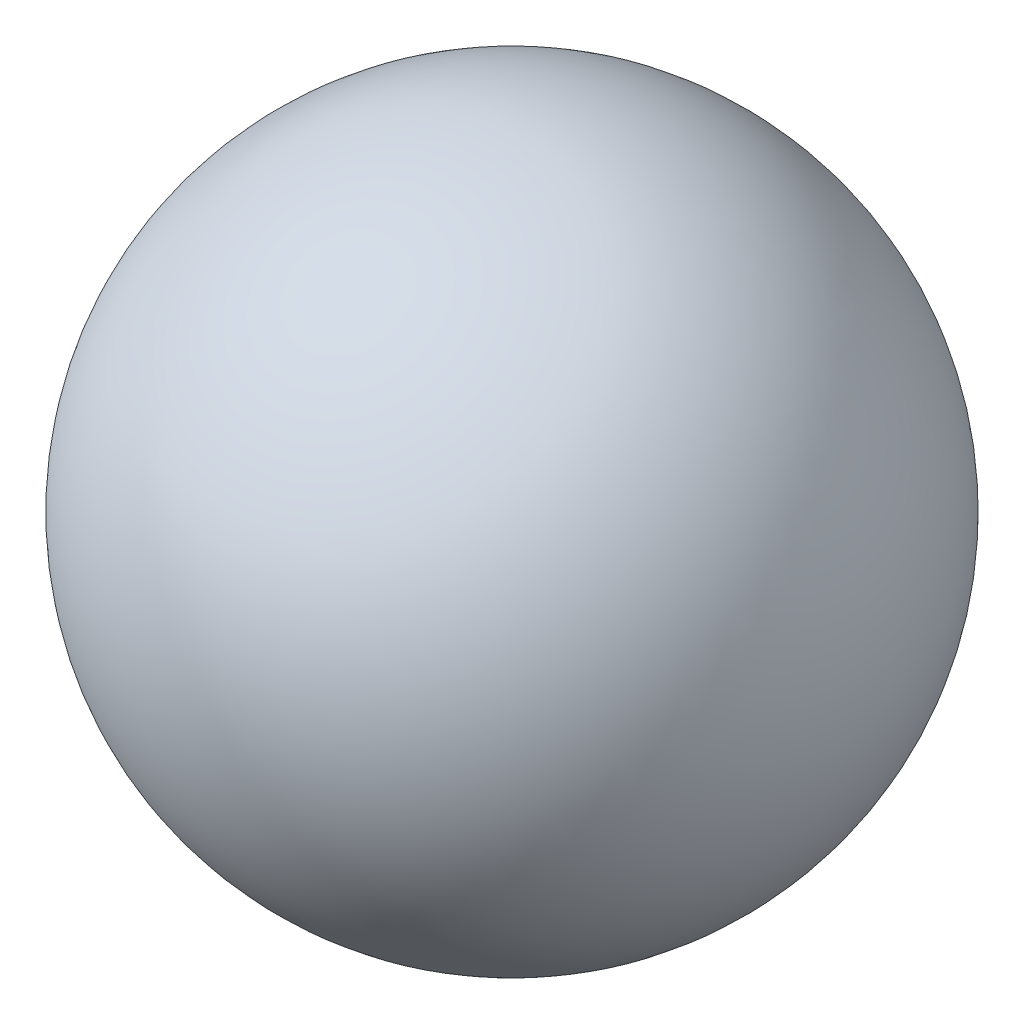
from build123d import *


with BuildPart() as part:
    # Croquis1 → Revoluci_n10 (revolve)
    with BuildSketch(Plane.XY):
        with BuildLine():
            Line((0, 4.65), (0, -4.65))
            ThreePointArc((0, -4.65), (-4.65, 0), (0, 4.65))
        make_face()
    revolve(axis=Axis((0, 10.637642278, 0), (0, 1, 0)))


solid = part.part
